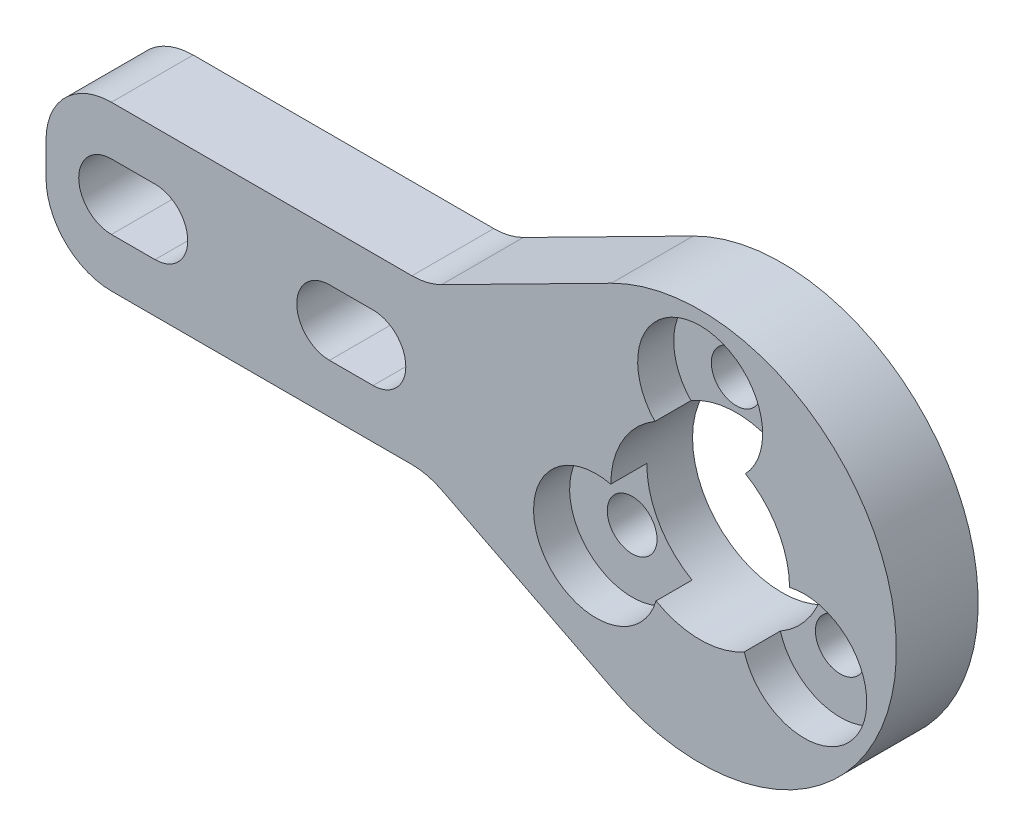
ISO-10303-21;
HEADER;
FILE_DESCRIPTION(('STEP AP214'),'2;1');
FILE_NAME('part.step','',(''),(''),'','','');
FILE_SCHEMA(('AUTOMOTIVE_DESIGN { 1 0 10303 214 1 1 1 1 }'));
ENDSEC;
DATA;
#1=APPLICATION_CONTEXT('core data for automotive mechanical design processes');
#2=APPLICATION_PROTOCOL_DEFINITION('international standard','automotive_design',2000,#1);
#3=PRODUCT_CONTEXT('',#1,'mechanical');
#4=PRODUCT('Part','Part','',(#3));
#5=PRODUCT_RELATED_PRODUCT_CATEGORY('part','',(#4));
#6=PRODUCT_DEFINITION_FORMATION('','',#4);
#7=PRODUCT_DEFINITION_CONTEXT('part definition',#1,'design');
#8=PRODUCT_DEFINITION('design','',#6,#7);
#9=PRODUCT_DEFINITION_SHAPE('','',#8);
#10=(LENGTH_UNIT() NAMED_UNIT(*) SI_UNIT(.MILLI.,.METRE.));
#11=(NAMED_UNIT(*) PLANE_ANGLE_UNIT() SI_UNIT($,.RADIAN.));
#12=(NAMED_UNIT(*) SI_UNIT($,.STERADIAN.) SOLID_ANGLE_UNIT());
#13=UNCERTAINTY_MEASURE_WITH_UNIT(LENGTH_MEASURE(1.E-05),#10,'distance_accuracy_value','');
#14=(GEOMETRIC_REPRESENTATION_CONTEXT(3) GLOBAL_UNCERTAINTY_ASSIGNED_CONTEXT((#13)) GLOBAL_UNIT_ASSIGNED_CONTEXT((#10,
#11,#12)) REPRESENTATION_CONTEXT('',''));
#15=CARTESIAN_POINT('',(0.,0.,0.));
#16=DIRECTION('',(0.,0.,1.));
#17=DIRECTION('',(1.,0.,0.));
#18=AXIS2_PLACEMENT_3D('',#15,#16,#17);
#19=CARTESIAN_POINT('',(0.,0.,4.7625));
#20=DIRECTION('',(0.,0.,1.));
#21=DIRECTION('',(1.,0.,0.));
#22=AXIS2_PLACEMENT_3D('',#19,#20,#21);
#23=PLANE('',#22);
#24=CARTESIAN_POINT('',(-19.05,0.,4.7625));
#25=DIRECTION('',(0.,0.,1.));
#26=DIRECTION('',(1.,0.,0.));
#27=AXIS2_PLACEMENT_3D('',#24,#25,#26);
#28=CIRCLE('',#27,1.905);
#29=CARTESIAN_POINT('',(-19.05,-1.905,4.7625));
#30=VERTEX_POINT('',#29);
#31=CARTESIAN_POINT('',(-19.05,1.905,4.7625));
#32=VERTEX_POINT('',#31);
#33=EDGE_CURVE('E222',#30,#32,#28,.T.);
#34=ORIENTED_EDGE('',*,*,#33,.F.);
#35=DIRECTION('',(1.,0.,0.));
#36=VECTOR('',#35,1.);
#37=CARTESIAN_POINT('',(-21.59,-1.905,4.7625));
#38=LINE('',#37,#36);
#39=CARTESIAN_POINT('',(-21.59,-1.905,4.7625));
#40=VERTEX_POINT('',#39);
#41=EDGE_CURVE('E226',#40,#30,#38,.T.);
#42=ORIENTED_EDGE('',*,*,#41,.F.);
#43=CARTESIAN_POINT('',(-21.59,0.,4.7625));
#44=DIRECTION('',(0.,0.,1.));
#45=DIRECTION('',(1.,0.,0.));
#46=AXIS2_PLACEMENT_3D('',#43,#44,#45);
#47=CIRCLE('',#46,1.905);
#48=CARTESIAN_POINT('',(-21.59,1.905,4.7625));
#49=VERTEX_POINT('',#48);
#50=EDGE_CURVE('E206',#49,#40,#47,.T.);
#51=ORIENTED_EDGE('',*,*,#50,.F.);
#52=DIRECTION('',(-1.,0.,0.));
#53=VECTOR('',#52,1.);
#54=CARTESIAN_POINT('',(-19.05,1.905,4.7625));
#55=LINE('',#54,#53);
#56=EDGE_CURVE('E218',#32,#49,#55,.T.);
#57=ORIENTED_EDGE('',*,*,#56,.F.);
#58=EDGE_LOOP('',(#34,#42,#51,#57));
#59=FACE_BOUND('',#58,.T.);
#60=CARTESIAN_POINT('',(-34.29,0.,4.7625));
#61=DIRECTION('',(0.,0.,1.));
#62=DIRECTION('',(-1.,0.,0.));
#63=AXIS2_PLACEMENT_3D('',#60,#61,#62);
#64=CIRCLE('',#63,1.905);
#65=CARTESIAN_POINT('',(-34.29,1.905,4.7625));
#66=VERTEX_POINT('',#65);
#67=CARTESIAN_POINT('',(-34.29,-1.905,4.7625));
#68=VERTEX_POINT('',#67);
#69=EDGE_CURVE('E242',#66,#68,#64,.T.);
#70=ORIENTED_EDGE('',*,*,#69,.F.);
#71=DIRECTION('',(-1.,0.,0.));
#72=VECTOR('',#71,1.);
#73=CARTESIAN_POINT('',(-34.29,1.905,4.7625));
#74=LINE('',#73,#72);
#75=CARTESIAN_POINT('',(-31.75,1.905,4.7625));
#76=VERTEX_POINT('',#75);
#77=EDGE_CURVE('E252',#76,#66,#74,.T.);
#78=ORIENTED_EDGE('',*,*,#77,.F.);
#79=CARTESIAN_POINT('',(-31.75,0.,4.7625));
#80=DIRECTION('',(0.,0.,1.));
#81=DIRECTION('',(-1.,0.,0.));
#82=AXIS2_PLACEMENT_3D('',#79,#80,#81);
#83=CIRCLE('',#82,1.905);
#84=CARTESIAN_POINT('',(-31.75,-1.905,4.7625));
#85=VERTEX_POINT('',#84);
#86=EDGE_CURVE('E249',#85,#76,#83,.T.);
#87=ORIENTED_EDGE('',*,*,#86,.F.);
#88=DIRECTION('',(1.,0.,0.));
#89=VECTOR('',#88,1.);
#90=CARTESIAN_POINT('',(-31.75,-1.905,4.7625));
#91=LINE('',#90,#89);
#92=EDGE_CURVE('E246',#68,#85,#91,.T.);
#93=ORIENTED_EDGE('',*,*,#92,.F.);
#94=EDGE_LOOP('',(#70,#78,#87,#93));
#95=FACE_BOUND('',#94,.T.);
#96=CARTESIAN_POINT('',(0.,7.,4.7625));
#97=DIRECTION('',(0.,0.,1.));
#98=DIRECTION('',(1.,0.,0.));
#99=AXIS2_PLACEMENT_3D('',#96,#97,#98);
#100=CIRCLE('',#99,3.64);
#101=CARTESIAN_POINT('',(2.63641137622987,4.49023207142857,4.7625));
#102=VERTEX_POINT('',#101);
#103=CARTESIAN_POINT('',(-2.63641137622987,4.49023207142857,4.7625));
#104=VERTEX_POINT('',#103);
#105=EDGE_CURVE('E284',#102,#104,#100,.T.);
#106=ORIENTED_EDGE('',*,*,#105,.F.);
#107=CARTESIAN_POINT('',(0.,0.,4.7625));
#108=DIRECTION('',(0.,0.,1.));
#109=DIRECTION('',(1.,0.,0.));
#110=AXIS2_PLACEMENT_3D('',#107,#108,#109);
#111=CIRCLE('',#110,5.207);
#112=CARTESIAN_POINT('',(5.2068607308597,0.0380831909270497,4.7625));
#113=VERTEX_POINT('',#112);
#114=EDGE_CURVE('E314',#113,#102,#111,.T.);
#115=ORIENTED_EDGE('',*,*,#114,.F.);
#116=CARTESIAN_POINT('',(6.06217782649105,-3.50000000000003,4.7625));
#117=DIRECTION('',(0.,0.,1.));
#118=DIRECTION('',(1.,0.,0.));
#119=AXIS2_PLACEMENT_3D('',#116,#117,#118);
#120=CIRCLE('',#119,3.64);
#121=CARTESIAN_POINT('',(2.57044935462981,-4.52831526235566,4.7625));
#122=VERTEX_POINT('',#121);
#123=EDGE_CURVE('E294',#122,#113,#120,.T.);
#124=ORIENTED_EDGE('',*,*,#123,.F.);
#125=CARTESIAN_POINT('',(-2.57044935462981,-4.52831526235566,4.7625));
#126=VERTEX_POINT('',#125);
#127=EDGE_CURVE('E310',#126,#122,#111,.T.);
#128=ORIENTED_EDGE('',*,*,#127,.F.);
#129=CARTESIAN_POINT('',(-6.06217782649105,-3.50000000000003,4.7625));
#130=DIRECTION('',(0.,0.,1.));
#131=DIRECTION('',(1.,0.,0.));
#132=AXIS2_PLACEMENT_3D('',#129,#130,#131);
#133=CIRCLE('',#132,3.64);
#134=CARTESIAN_POINT('',(-5.2068607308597,0.0380831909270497,4.7625));
#135=VERTEX_POINT('',#134);
#136=EDGE_CURVE('E304',#135,#126,#133,.T.);
#137=ORIENTED_EDGE('',*,*,#136,.F.);
#138=EDGE_CURVE('E309',#104,#135,#111,.T.);
#139=ORIENTED_EDGE('',*,*,#138,.F.);
#140=EDGE_LOOP('',(#106,#115,#124,#128,#137,#139));
#141=FACE_BOUND('',#140,.T.);
#142=DIRECTION('',(0.,-1.,0.));
#143=VECTOR('',#142,1.);
#144=CARTESIAN_POINT('',(-38.1,4.7625,4.7625));
#145=LINE('',#144,#143);
#146=CARTESIAN_POINT('',(-38.1,0.952499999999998,4.7625));
#147=VERTEX_POINT('',#146);
#148=CARTESIAN_POINT('',(-38.1,-0.952500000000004,4.7625));
#149=VERTEX_POINT('',#148);
#150=EDGE_CURVE('E338',#147,#149,#145,.T.);
#151=ORIENTED_EDGE('',*,*,#150,.T.);
#152=CARTESIAN_POINT('',(-34.29,-0.952500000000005,4.7625));
#153=DIRECTION('',(0.,0.,1.));
#154=DIRECTION('',(1.,0.,0.));
#155=AXIS2_PLACEMENT_3D('',#152,#153,#154);
#156=CIRCLE('',#155,3.81);
#157=CARTESIAN_POINT('',(-34.29,-4.7625,4.7625));
#158=VERTEX_POINT('',#157);
#159=EDGE_CURVE('E397',#149,#158,#156,.T.);
#160=ORIENTED_EDGE('',*,*,#159,.T.);
#161=DIRECTION('',(1.,0.,0.));
#162=VECTOR('',#161,1.);
#163=CARTESIAN_POINT('',(-15.875,-4.7625,4.7625));
#164=LINE('',#163,#162);
#165=CARTESIAN_POINT('',(-16.7862536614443,-4.7625,4.7625));
#166=VERTEX_POINT('',#165);
#167=EDGE_CURVE('E340',#158,#166,#164,.T.);
#168=ORIENTED_EDGE('',*,*,#167,.T.);
#169=CARTESIAN_POINT('',(-16.7862536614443,-8.5725,4.7625));
#170=DIRECTION('',(0.,0.,1.));
#171=DIRECTION('',(1.,0.,0.));
#172=AXIS2_PLACEMENT_3D('',#169,#170,#171);
#173=CIRCLE('',#172,3.81);
#174=CARTESIAN_POINT('',(-15.0623604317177,-5.17481076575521,4.7625));
#175=VERTEX_POINT('',#174);
#176=EDGE_CURVE('E401',#166,#175,#173,.F.);
#177=ORIENTED_EDGE('',*,*,#176,.T.);
#178=DIRECTION('',(0.891781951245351,-0.452465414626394,0.));
#179=VECTOR('',#178,1.);
#180=CARTESIAN_POINT('',(-5.17167968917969,-10.1930677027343,4.7625));
#181=LINE('',#180,#179);
#182=CARTESIAN_POINT('',(-5.17167968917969,-10.1930677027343,4.7625));
#183=VERTEX_POINT('',#182);
#184=EDGE_CURVE('E343',#175,#183,#181,.T.);
#185=ORIENTED_EDGE('',*,*,#184,.T.);
#186=CARTESIAN_POINT('',(0.,0.,4.7625));
#187=DIRECTION('',(0.,0.,1.));
#188=DIRECTION('',(1.,0.,0.));
#189=AXIS2_PLACEMENT_3D('',#186,#187,#188);
#190=CIRCLE('',#189,11.43);
#191=CARTESIAN_POINT('',(-5.1716796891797,10.1930677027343,4.7625));
#192=VERTEX_POINT('',#191);
#193=EDGE_CURVE('E330',#183,#192,#190,.T.);
#194=ORIENTED_EDGE('',*,*,#193,.T.);
#195=DIRECTION('',(-0.891781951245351,-0.452465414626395,0.));
#196=VECTOR('',#195,1.);
#197=CARTESIAN_POINT('',(-5.1716796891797,10.1930677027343,4.7625));
#198=LINE('',#197,#196);
#199=CARTESIAN_POINT('',(-15.0623604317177,5.17481076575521,4.7625));
#200=VERTEX_POINT('',#199);
#201=EDGE_CURVE('E333',#192,#200,#198,.T.);
#202=ORIENTED_EDGE('',*,*,#201,.T.);
#203=CARTESIAN_POINT('',(-16.7862536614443,8.5725,4.7625));
#204=DIRECTION('',(0.,0.,1.));
#205=DIRECTION('',(1.,0.,0.));
#206=AXIS2_PLACEMENT_3D('',#203,#204,#205);
#207=CIRCLE('',#206,3.81);
#208=CARTESIAN_POINT('',(-16.7862536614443,4.7625,4.7625));
#209=VERTEX_POINT('',#208);
#210=EDGE_CURVE('E13',#200,#209,#207,.F.);
#211=ORIENTED_EDGE('',*,*,#210,.T.);
#212=DIRECTION('',(-1.,0.,0.));
#213=VECTOR('',#212,1.);
#214=CARTESIAN_POINT('',(-15.875,4.7625,4.7625));
#215=LINE('',#214,#213);
#216=CARTESIAN_POINT('',(-34.29,4.7625,4.7625));
#217=VERTEX_POINT('',#216);
#218=EDGE_CURVE('E336',#209,#217,#215,.T.);
#219=ORIENTED_EDGE('',*,*,#218,.T.);
#220=CARTESIAN_POINT('',(-34.29,0.952499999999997,4.7625));
#221=DIRECTION('',(0.,0.,1.));
#222=DIRECTION('',(1.,0.,0.));
#223=AXIS2_PLACEMENT_3D('',#220,#221,#222);
#224=CIRCLE('',#223,3.81);
#225=EDGE_CURVE('E62',#217,#147,#224,.T.);
#226=ORIENTED_EDGE('',*,*,#225,.T.);
#227=EDGE_LOOP('',(#151,#160,#168,#177,#185,#194,#202,#211,#219,#226));
#228=FACE_BOUND('',#227,.T.);
#229=ADVANCED_FACE('F40',(#59,#95,#141,#228),#23,.T.);
#230=CARTESIAN_POINT('',(0.,0.,0.));
#231=DIRECTION('',(0.,0.,1.));
#232=DIRECTION('',(1.,0.,0.));
#233=AXIS2_PLACEMENT_3D('',#230,#231,#232);
#234=PLANE('',#233);
#235=DIRECTION('',(1.,0.,0.));
#236=VECTOR('',#235,1.);
#237=CARTESIAN_POINT('',(-21.59,-1.905,0.));
#238=LINE('',#237,#236);
#239=CARTESIAN_POINT('',(-21.59,-1.905,0.));
#240=VERTEX_POINT('',#239);
#241=CARTESIAN_POINT('',(-19.05,-1.905,0.));
#242=VERTEX_POINT('',#241);
#243=EDGE_CURVE('E237',#240,#242,#238,.T.);
#244=ORIENTED_EDGE('',*,*,#243,.T.);
#245=CARTESIAN_POINT('',(-19.05,0.,0.));
#246=DIRECTION('',(0.,0.,1.));
#247=DIRECTION('',(1.,0.,0.));
#248=AXIS2_PLACEMENT_3D('',#245,#246,#247);
#249=CIRCLE('',#248,1.905);
#250=CARTESIAN_POINT('',(-19.05,1.905,0.));
#251=VERTEX_POINT('',#250);
#252=EDGE_CURVE('E228',#242,#251,#249,.T.);
#253=ORIENTED_EDGE('',*,*,#252,.T.);
#254=DIRECTION('',(-1.,0.,0.));
#255=VECTOR('',#254,1.);
#256=CARTESIAN_POINT('',(-19.05,1.905,0.));
#257=LINE('',#256,#255);
#258=CARTESIAN_POINT('',(-21.59,1.905,0.));
#259=VERTEX_POINT('',#258);
#260=EDGE_CURVE('E234',#251,#259,#257,.T.);
#261=ORIENTED_EDGE('',*,*,#260,.T.);
#262=CARTESIAN_POINT('',(-21.59,0.,0.));
#263=DIRECTION('',(0.,0.,1.));
#264=DIRECTION('',(1.,0.,0.));
#265=AXIS2_PLACEMENT_3D('',#262,#263,#264);
#266=CIRCLE('',#265,1.905);
#267=EDGE_CURVE('E209',#259,#240,#266,.T.);
#268=ORIENTED_EDGE('',*,*,#267,.T.);
#269=EDGE_LOOP('',(#244,#253,#261,#268));
#270=FACE_BOUND('',#269,.T.);
#271=DIRECTION('',(-1.,0.,0.));
#272=VECTOR('',#271,1.);
#273=CARTESIAN_POINT('',(-34.29,1.905,0.));
#274=LINE('',#273,#272);
#275=CARTESIAN_POINT('',(-31.75,1.905,0.));
#276=VERTEX_POINT('',#275);
#277=CARTESIAN_POINT('',(-34.29,1.905,0.));
#278=VERTEX_POINT('',#277);
#279=EDGE_CURVE('E264',#276,#278,#274,.T.);
#280=ORIENTED_EDGE('',*,*,#279,.T.);
#281=CARTESIAN_POINT('',(-34.29,0.,0.));
#282=DIRECTION('',(0.,0.,1.));
#283=DIRECTION('',(-1.,0.,0.));
#284=AXIS2_PLACEMENT_3D('',#281,#282,#283);
#285=CIRCLE('',#284,1.905);
#286=CARTESIAN_POINT('',(-34.29,-1.905,0.));
#287=VERTEX_POINT('',#286);
#288=EDGE_CURVE('E255',#278,#287,#285,.T.);
#289=ORIENTED_EDGE('',*,*,#288,.T.);
#290=DIRECTION('',(1.,0.,0.));
#291=VECTOR('',#290,1.);
#292=CARTESIAN_POINT('',(-31.75,-1.905,0.));
#293=LINE('',#292,#291);
#294=CARTESIAN_POINT('',(-31.75,-1.905,0.));
#295=VERTEX_POINT('',#294);
#296=EDGE_CURVE('E258',#287,#295,#293,.T.);
#297=ORIENTED_EDGE('',*,*,#296,.T.);
#298=CARTESIAN_POINT('',(-31.75,0.,0.));
#299=DIRECTION('',(0.,0.,1.));
#300=DIRECTION('',(-1.,0.,0.));
#301=AXIS2_PLACEMENT_3D('',#298,#299,#300);
#302=CIRCLE('',#301,1.905);
#303=EDGE_CURVE('E261',#295,#276,#302,.T.);
#304=ORIENTED_EDGE('',*,*,#303,.T.);
#305=EDGE_LOOP('',(#280,#289,#297,#304));
#306=FACE_BOUND('',#305,.T.);
#307=CARTESIAN_POINT('',(0.,7.,0.));
#308=DIRECTION('',(0.,0.,1.));
#309=DIRECTION('',(1.,0.,0.));
#310=AXIS2_PLACEMENT_3D('',#307,#308,#309);
#311=CIRCLE('',#310,1.45);
#312=CARTESIAN_POINT('',(1.45,7.,0.));
#313=VERTEX_POINT('',#312);
#314=EDGE_CURVE('E270',#313,#313,#311,.T.);
#315=ORIENTED_EDGE('',*,*,#314,.T.);
#316=EDGE_LOOP('',(#315));
#317=FACE_BOUND('',#316,.T.);
#318=CARTESIAN_POINT('',(6.06217782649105,-3.50000000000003,0.));
#319=DIRECTION('',(0.,0.,1.));
#320=DIRECTION('',(1.,0.,0.));
#321=AXIS2_PLACEMENT_3D('',#318,#319,#320);
#322=CIRCLE('',#321,1.45);
#323=CARTESIAN_POINT('',(7.51217782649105,-3.50000000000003,0.));
#324=VERTEX_POINT('',#323);
#325=EDGE_CURVE('E286',#324,#324,#322,.T.);
#326=ORIENTED_EDGE('',*,*,#325,.T.);
#327=EDGE_LOOP('',(#326));
#328=FACE_BOUND('',#327,.T.);
#329=CARTESIAN_POINT('',(-6.06217782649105,-3.50000000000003,0.));
#330=DIRECTION('',(0.,0.,1.));
#331=DIRECTION('',(1.,0.,0.));
#332=AXIS2_PLACEMENT_3D('',#329,#330,#331);
#333=CIRCLE('',#332,1.45);
#334=CARTESIAN_POINT('',(-4.61217782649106,-3.50000000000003,0.));
#335=VERTEX_POINT('',#334);
#336=EDGE_CURVE('E296',#335,#335,#333,.T.);
#337=ORIENTED_EDGE('',*,*,#336,.T.);
#338=EDGE_LOOP('',(#337));
#339=FACE_BOUND('',#338,.T.);
#340=DIRECTION('',(1.,0.,0.));
#341=VECTOR('',#340,1.);
#342=CARTESIAN_POINT('',(-15.875,-4.7625,0.));
#343=LINE('',#342,#341);
#344=CARTESIAN_POINT('',(-34.29,-4.7625,0.));
#345=VERTEX_POINT('',#344);
#346=CARTESIAN_POINT('',(-16.7862536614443,-4.7625,0.));
#347=VERTEX_POINT('',#346);
#348=EDGE_CURVE('E325',#345,#347,#343,.T.);
#349=ORIENTED_EDGE('',*,*,#348,.F.);
#350=CARTESIAN_POINT('',(-34.29,-0.952500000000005,0.));
#351=DIRECTION('',(0.,0.,1.));
#352=DIRECTION('',(1.,0.,0.));
#353=AXIS2_PLACEMENT_3D('',#350,#351,#352);
#354=CIRCLE('',#353,3.81);
#355=CARTESIAN_POINT('',(-38.1,-0.952500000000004,0.));
#356=VERTEX_POINT('',#355);
#357=EDGE_CURVE('E390',#345,#356,#354,.F.);
#358=ORIENTED_EDGE('',*,*,#357,.T.);
#359=DIRECTION('',(0.,-1.,0.));
#360=VECTOR('',#359,1.);
#361=CARTESIAN_POINT('',(-38.1,4.7625,0.));
#362=LINE('',#361,#360);
#363=CARTESIAN_POINT('',(-38.1,0.952499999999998,0.));
#364=VERTEX_POINT('',#363);
#365=EDGE_CURVE('E323',#364,#356,#362,.T.);
#366=ORIENTED_EDGE('',*,*,#365,.F.);
#367=CARTESIAN_POINT('',(-34.29,0.952499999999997,0.));
#368=DIRECTION('',(0.,0.,1.));
#369=DIRECTION('',(1.,0.,0.));
#370=AXIS2_PLACEMENT_3D('',#367,#368,#369);
#371=CIRCLE('',#370,3.81);
#372=CARTESIAN_POINT('',(-34.29,4.7625,0.));
#373=VERTEX_POINT('',#372);
#374=EDGE_CURVE('E388',#364,#373,#371,.F.);
#375=ORIENTED_EDGE('',*,*,#374,.T.);
#376=DIRECTION('',(-1.,0.,0.));
#377=VECTOR('',#376,1.);
#378=CARTESIAN_POINT('',(-15.875,4.7625,0.));
#379=LINE('',#378,#377);
#380=CARTESIAN_POINT('',(-16.7862536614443,4.7625,0.));
#381=VERTEX_POINT('',#380);
#382=EDGE_CURVE('E320',#381,#373,#379,.T.);
#383=ORIENTED_EDGE('',*,*,#382,.F.);
#384=CARTESIAN_POINT('',(-16.7862536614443,8.5725,0.));
#385=DIRECTION('',(0.,0.,1.));
#386=DIRECTION('',(1.,0.,0.));
#387=AXIS2_PLACEMENT_3D('',#384,#385,#386);
#388=CIRCLE('',#387,3.81);
#389=CARTESIAN_POINT('',(-15.0623604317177,5.17481076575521,0.));
#390=VERTEX_POINT('',#389);
#391=EDGE_CURVE('E48',#381,#390,#388,.T.);
#392=ORIENTED_EDGE('',*,*,#391,.T.);
#393=DIRECTION('',(-0.891781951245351,-0.452465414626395,0.));
#394=VECTOR('',#393,1.);
#395=CARTESIAN_POINT('',(-5.1716796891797,10.1930677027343,0.));
#396=LINE('',#395,#394);
#397=CARTESIAN_POINT('',(-5.1716796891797,10.1930677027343,0.));
#398=VERTEX_POINT('',#397);
#399=EDGE_CURVE('E317',#398,#390,#396,.T.);
#400=ORIENTED_EDGE('',*,*,#399,.F.);
#401=CARTESIAN_POINT('',(0.,0.,0.));
#402=DIRECTION('',(0.,0.,1.));
#403=DIRECTION('',(1.,0.,0.));
#404=AXIS2_PLACEMENT_3D('',#401,#402,#403);
#405=CIRCLE('',#404,11.43);
#406=CARTESIAN_POINT('',(-5.17167968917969,-10.1930677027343,0.));
#407=VERTEX_POINT('',#406);
#408=EDGE_CURVE('E313',#407,#398,#405,.T.);
#409=ORIENTED_EDGE('',*,*,#408,.F.);
#410=DIRECTION('',(0.891781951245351,-0.452465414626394,0.));
#411=VECTOR('',#410,1.);
#412=CARTESIAN_POINT('',(-5.17167968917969,-10.1930677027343,0.));
#413=LINE('',#412,#411);
#414=CARTESIAN_POINT('',(-15.0623604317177,-5.17481076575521,0.));
#415=VERTEX_POINT('',#414);
#416=EDGE_CURVE('E328',#415,#407,#413,.T.);
#417=ORIENTED_EDGE('',*,*,#416,.F.);
#418=CARTESIAN_POINT('',(-16.7862536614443,-8.5725,0.));
#419=DIRECTION('',(0.,0.,1.));
#420=DIRECTION('',(1.,0.,0.));
#421=AXIS2_PLACEMENT_3D('',#418,#419,#420);
#422=CIRCLE('',#421,3.81);
#423=EDGE_CURVE('E399',#415,#347,#422,.T.);
#424=ORIENTED_EDGE('',*,*,#423,.T.);
#425=EDGE_LOOP('',(#349,#358,#366,#375,#383,#392,#400,#409,#417,#424));
#426=FACE_BOUND('',#425,.T.);
#427=CARTESIAN_POINT('',(0.,0.,0.));
#428=DIRECTION('',(0.,0.,1.));
#429=DIRECTION('',(1.,0.,0.));
#430=AXIS2_PLACEMENT_3D('',#427,#428,#429);
#431=CIRCLE('',#430,5.207);
#432=CARTESIAN_POINT('',(5.207,0.,0.));
#433=VERTEX_POINT('',#432);
#434=EDGE_CURVE('E306',#433,#433,#431,.T.);
#435=ORIENTED_EDGE('',*,*,#434,.T.);
#436=EDGE_LOOP('',(#435));
#437=FACE_BOUND('',#436,.T.);
#438=ADVANCED_FACE('F405',(#270,#306,#317,#328,#339,#426,#437),#234,.F.);
#439=CARTESIAN_POINT('',(0.,0.,4.7625));
#440=DIRECTION('',(0.,0.,-1.));
#441=DIRECTION('',(-1.,0.,0.));
#442=AXIS2_PLACEMENT_3D('',#439,#440,#441);
#443=CYLINDRICAL_SURFACE('',#442,11.43);
#444=ORIENTED_EDGE('',*,*,#408,.T.);
#445=DIRECTION('',(0.,0.,-1.));
#446=VECTOR('',#445,1.);
#447=CARTESIAN_POINT('',(-5.1716796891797,10.1930677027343,4.7625));
#448=LINE('',#447,#446);
#449=EDGE_CURVE('E348',#192,#398,#448,.T.);
#450=ORIENTED_EDGE('',*,*,#449,.F.);
#451=ORIENTED_EDGE('',*,*,#193,.F.);
#452=DIRECTION('',(0.,0.,-1.));
#453=VECTOR('',#452,1.);
#454=CARTESIAN_POINT('',(-5.17167968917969,-10.1930677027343,4.7625));
#455=LINE('',#454,#453);
#456=EDGE_CURVE('E345',#183,#407,#455,.T.);
#457=ORIENTED_EDGE('',*,*,#456,.T.);
#458=EDGE_LOOP('',(#444,#450,#451,#457));
#459=FACE_BOUND('',#458,.T.);
#460=ADVANCED_FACE('F42',(#459),#443,.T.);
#461=CARTESIAN_POINT('',(-5.1716796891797,10.1930677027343,4.7625));
#462=DIRECTION('',(0.452465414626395,-0.891781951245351,0.));
#463=DIRECTION('',(0.891781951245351,0.452465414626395,0.));
#464=AXIS2_PLACEMENT_3D('',#461,#462,#463);
#465=PLANE('',#464);
#466=ORIENTED_EDGE('',*,*,#399,.T.);
#467=DIRECTION('',(0.,0.,-1.));
#468=VECTOR('',#467,1.);
#469=CARTESIAN_POINT('',(-15.0623604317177,5.17481076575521,4.7625));
#470=LINE('',#469,#468);
#471=EDGE_CURVE('E386',#390,#200,#470,.F.);
#472=ORIENTED_EDGE('',*,*,#471,.T.);
#473=ORIENTED_EDGE('',*,*,#201,.F.);
#474=ORIENTED_EDGE('',*,*,#449,.T.);
#475=EDGE_LOOP('',(#466,#472,#473,#474));
#476=FACE_BOUND('',#475,.T.);
#477=ADVANCED_FACE('F412',(#476),#465,.F.);
#478=CARTESIAN_POINT('',(-15.875,4.7625,4.7625));
#479=DIRECTION('',(0.,-1.,0.));
#480=DIRECTION('',(1.,0.,0.));
#481=AXIS2_PLACEMENT_3D('',#478,#479,#480);
#482=PLANE('',#481);
#483=ORIENTED_EDGE('',*,*,#218,.F.);
#484=DIRECTION('',(0.,0.,-1.));
#485=VECTOR('',#484,1.);
#486=CARTESIAN_POINT('',(-16.7862536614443,4.7625,0.));
#487=LINE('',#486,#485);
#488=EDGE_CURVE('E383',#209,#381,#487,.T.);
#489=ORIENTED_EDGE('',*,*,#488,.T.);
#490=ORIENTED_EDGE('',*,*,#382,.T.);
#491=DIRECTION('',(0.,0.,-1.));
#492=VECTOR('',#491,1.);
#493=CARTESIAN_POINT('',(-34.29,4.7625,4.7625));
#494=LINE('',#493,#492);
#495=EDGE_CURVE('E381',#373,#217,#494,.F.);
#496=ORIENTED_EDGE('',*,*,#495,.T.);
#497=EDGE_LOOP('',(#483,#489,#490,#496));
#498=FACE_BOUND('',#497,.T.);
#499=ADVANCED_FACE('F418',(#498),#482,.F.);
#500=CARTESIAN_POINT('',(-38.1,4.7625,4.7625));
#501=DIRECTION('',(1.,0.,0.));
#502=DIRECTION('',(0.,0.,-1.));
#503=AXIS2_PLACEMENT_3D('',#500,#501,#502);
#504=PLANE('',#503);
#505=ORIENTED_EDGE('',*,*,#365,.T.);
#506=DIRECTION('',(0.,0.,-1.));
#507=VECTOR('',#506,1.);
#508=CARTESIAN_POINT('',(-38.1,-0.952500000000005,4.7625));
#509=LINE('',#508,#507);
#510=EDGE_CURVE('E55',#356,#149,#509,.F.);
#511=ORIENTED_EDGE('',*,*,#510,.T.);
#512=ORIENTED_EDGE('',*,*,#150,.F.);
#513=DIRECTION('',(0.,0.,-1.));
#514=VECTOR('',#513,1.);
#515=CARTESIAN_POINT('',(-38.1,0.952499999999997,4.7625));
#516=LINE('',#515,#514);
#517=EDGE_CURVE('E392',#147,#364,#516,.T.);
#518=ORIENTED_EDGE('',*,*,#517,.T.);
#519=EDGE_LOOP('',(#505,#511,#512,#518));
#520=FACE_BOUND('',#519,.T.);
#521=ADVANCED_FACE('F424',(#520),#504,.F.);
#522=CARTESIAN_POINT('',(-15.875,-4.7625,4.7625));
#523=DIRECTION('',(0.,1.,0.));
#524=DIRECTION('',(-1.,0.,0.));
#525=AXIS2_PLACEMENT_3D('',#522,#523,#524);
#526=PLANE('',#525);
#527=ORIENTED_EDGE('',*,*,#348,.T.);
#528=DIRECTION('',(0.,0.,-1.));
#529=VECTOR('',#528,1.);
#530=CARTESIAN_POINT('',(-16.7862536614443,-4.7625,4.7625));
#531=LINE('',#530,#529);
#532=EDGE_CURVE('E379',#347,#166,#531,.F.);
#533=ORIENTED_EDGE('',*,*,#532,.T.);
#534=ORIENTED_EDGE('',*,*,#167,.F.);
#535=DIRECTION('',(0.,0.,-1.));
#536=VECTOR('',#535,1.);
#537=CARTESIAN_POINT('',(-34.29,-4.7625,4.7625));
#538=LINE('',#537,#536);
#539=EDGE_CURVE('E376',#158,#345,#538,.T.);
#540=ORIENTED_EDGE('',*,*,#539,.T.);
#541=EDGE_LOOP('',(#527,#533,#534,#540));
#542=FACE_BOUND('',#541,.T.);
#543=ADVANCED_FACE('F431',(#542),#526,.F.);
#544=CARTESIAN_POINT('',(-5.17167968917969,-10.1930677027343,4.7625));
#545=DIRECTION('',(0.452465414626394,0.891781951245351,0.));
#546=DIRECTION('',(-0.891781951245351,0.452465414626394,0.));
#547=AXIS2_PLACEMENT_3D('',#544,#545,#546);
#548=PLANE('',#547);
#549=ORIENTED_EDGE('',*,*,#184,.F.);
#550=DIRECTION('',(0.,0.,-1.));
#551=VECTOR('',#550,1.);
#552=CARTESIAN_POINT('',(-15.0623604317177,-5.17481076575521,0.));
#553=LINE('',#552,#551);
#554=EDGE_CURVE('E373',#175,#415,#553,.T.);
#555=ORIENTED_EDGE('',*,*,#554,.T.);
#556=ORIENTED_EDGE('',*,*,#416,.T.);
#557=ORIENTED_EDGE('',*,*,#456,.F.);
#558=EDGE_LOOP('',(#549,#555,#556,#557));
#559=FACE_BOUND('',#558,.T.);
#560=ADVANCED_FACE('F440',(#559),#548,.F.);
#561=CARTESIAN_POINT('',(0.,0.,4.7625));
#562=DIRECTION('',(0.,0.,-1.));
#563=DIRECTION('',(-1.,0.,0.));
#564=AXIS2_PLACEMENT_3D('',#561,#562,#563);
#565=CYLINDRICAL_SURFACE('',#564,5.207);
#566=DIRECTION('',(0.,0.,1.));
#567=VECTOR('',#566,1.);
#568=CARTESIAN_POINT('',(2.63641137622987,4.49023207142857,3.7125));
#569=LINE('',#568,#567);
#570=CARTESIAN_POINT('',(2.63641137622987,4.49023207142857,2.6625));
#571=VERTEX_POINT('',#570);
#572=EDGE_CURVE('E371',#571,#102,#569,.T.);
#573=ORIENTED_EDGE('',*,*,#572,.F.);
#574=CARTESIAN_POINT('',(0.,0.,2.6625));
#575=DIRECTION('',(0.,0.,-1.));
#576=DIRECTION('',(-1.,0.,0.));
#577=AXIS2_PLACEMENT_3D('',#574,#575,#576);
#578=CIRCLE('',#577,5.207);
#579=CARTESIAN_POINT('',(-2.63641137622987,4.49023207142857,2.6625));
#580=VERTEX_POINT('',#579);
#581=EDGE_CURVE('E366',#580,#571,#578,.T.);
#582=ORIENTED_EDGE('',*,*,#581,.F.);
#583=DIRECTION('',(0.,0.,1.));
#584=VECTOR('',#583,1.);
#585=CARTESIAN_POINT('',(-2.63641137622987,4.49023207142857,3.7125));
#586=LINE('',#585,#584);
#587=EDGE_CURVE('E368',#104,#580,#586,.F.);
#588=ORIENTED_EDGE('',*,*,#587,.F.);
#589=ORIENTED_EDGE('',*,*,#138,.T.);
#590=DIRECTION('',(0.,0.,1.));
#591=VECTOR('',#590,1.);
#592=CARTESIAN_POINT('',(-5.2068607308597,0.0380831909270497,3.7125));
#593=LINE('',#592,#591);
#594=CARTESIAN_POINT('',(-5.2068607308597,0.0380831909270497,2.6625));
#595=VERTEX_POINT('',#594);
#596=EDGE_CURVE('E356',#595,#135,#593,.T.);
#597=ORIENTED_EDGE('',*,*,#596,.F.);
#598=CARTESIAN_POINT('',(0.,0.,2.6625));
#599=DIRECTION('',(0.,0.,-1.));
#600=DIRECTION('',(-1.,0.,0.));
#601=AXIS2_PLACEMENT_3D('',#598,#599,#600);
#602=CIRCLE('',#601,5.207);
#603=CARTESIAN_POINT('',(-2.57044935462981,-4.52831526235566,2.6625));
#604=VERTEX_POINT('',#603);
#605=EDGE_CURVE('E351',#604,#595,#602,.T.);
#606=ORIENTED_EDGE('',*,*,#605,.F.);
#607=DIRECTION('',(0.,0.,1.));
#608=VECTOR('',#607,1.);
#609=CARTESIAN_POINT('',(-2.57044935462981,-4.52831526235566,3.7125));
#610=LINE('',#609,#608);
#611=EDGE_CURVE('E353',#126,#604,#610,.F.);
#612=ORIENTED_EDGE('',*,*,#611,.F.);
#613=ORIENTED_EDGE('',*,*,#127,.T.);
#614=DIRECTION('',(0.,0.,1.));
#615=VECTOR('',#614,1.);
#616=CARTESIAN_POINT('',(2.57044935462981,-4.52831526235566,3.7125));
#617=LINE('',#616,#615);
#618=CARTESIAN_POINT('',(2.57044935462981,-4.52831526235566,2.6625));
#619=VERTEX_POINT('',#618);
#620=EDGE_CURVE('E364',#619,#122,#617,.T.);
#621=ORIENTED_EDGE('',*,*,#620,.F.);
#622=CARTESIAN_POINT('',(0.,0.,2.6625));
#623=DIRECTION('',(0.,0.,-1.));
#624=DIRECTION('',(-1.,0.,0.));
#625=AXIS2_PLACEMENT_3D('',#622,#623,#624);
#626=CIRCLE('',#625,5.207);
#627=CARTESIAN_POINT('',(5.2068607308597,0.0380831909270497,2.6625));
#628=VERTEX_POINT('',#627);
#629=EDGE_CURVE('E359',#628,#619,#626,.T.);
#630=ORIENTED_EDGE('',*,*,#629,.F.);
#631=DIRECTION('',(0.,0.,1.));
#632=VECTOR('',#631,1.);
#633=CARTESIAN_POINT('',(5.2068607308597,0.0380831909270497,3.7125));
#634=LINE('',#633,#632);
#635=EDGE_CURVE('E361',#113,#628,#634,.F.);
#636=ORIENTED_EDGE('',*,*,#635,.F.);
#637=ORIENTED_EDGE('',*,*,#114,.T.);
#638=EDGE_LOOP('',(#573,#582,#588,#589,#597,#606,#612,#613,#621,#630,#636,#637));
#639=FACE_BOUND('',#638,.T.);
#640=ORIENTED_EDGE('',*,*,#434,.F.);
#641=EDGE_LOOP('',(#640));
#642=FACE_BOUND('',#641,.T.);
#643=ADVANCED_FACE('F461',(#639,#642),#565,.F.);
#644=CARTESIAN_POINT('',(-6.06217782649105,-3.50000000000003,4.7625));
#645=DIRECTION('',(0.,0.,1.));
#646=DIRECTION('',(1.,0.,0.));
#647=AXIS2_PLACEMENT_3D('',#644,#645,#646);
#648=CYLINDRICAL_SURFACE('',#647,3.64);
#649=ORIENTED_EDGE('',*,*,#596,.T.);
#650=ORIENTED_EDGE('',*,*,#136,.T.);
#651=ORIENTED_EDGE('',*,*,#611,.T.);
#652=CARTESIAN_POINT('',(-6.06217782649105,-3.50000000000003,2.6625));
#653=DIRECTION('',(0.,0.,1.));
#654=DIRECTION('',(1.,0.,0.));
#655=AXIS2_PLACEMENT_3D('',#652,#653,#654);
#656=CIRCLE('',#655,3.64);
#657=EDGE_CURVE('E302',#595,#604,#656,.T.);
#658=ORIENTED_EDGE('',*,*,#657,.F.);
#659=EDGE_LOOP('',(#649,#650,#651,#658));
#660=FACE_BOUND('',#659,.T.);
#661=ADVANCED_FACE('F570',(#660),#648,.F.);
#662=CARTESIAN_POINT('',(-4.61217782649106,-3.50000000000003,2.6625));
#663=DIRECTION('',(0.,0.,-1.));
#664=DIRECTION('',(-1.,0.,0.));
#665=AXIS2_PLACEMENT_3D('',#662,#663,#664);
#666=PLANE('',#665);
#667=ORIENTED_EDGE('',*,*,#605,.T.);
#668=ORIENTED_EDGE('',*,*,#657,.T.);
#669=EDGE_LOOP('',(#667,#668));
#670=FACE_BOUND('',#669,.T.);
#671=CARTESIAN_POINT('',(-6.06217782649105,-3.50000000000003,2.6625));
#672=DIRECTION('',(0.,0.,1.));
#673=DIRECTION('',(1.,0.,0.));
#674=AXIS2_PLACEMENT_3D('',#671,#672,#673);
#675=CIRCLE('',#674,1.45);
#676=CARTESIAN_POINT('',(-4.61217782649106,-3.50000000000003,2.6625));
#677=VERTEX_POINT('',#676);
#678=EDGE_CURVE('E299',#677,#677,#675,.T.);
#679=ORIENTED_EDGE('',*,*,#678,.F.);
#680=EDGE_LOOP('',(#679));
#681=FACE_BOUND('',#680,.T.);
#682=ADVANCED_FACE('F566',(#670,#681),#666,.F.);
#683=CARTESIAN_POINT('',(-6.06217782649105,-3.50000000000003,4.7625));
#684=DIRECTION('',(0.,0.,1.));
#685=DIRECTION('',(1.,0.,0.));
#686=AXIS2_PLACEMENT_3D('',#683,#684,#685);
#687=CYLINDRICAL_SURFACE('',#686,1.45);
#688=ORIENTED_EDGE('',*,*,#336,.F.);
#689=EDGE_LOOP('',(#688));
#690=FACE_BOUND('',#689,.T.);
#691=ORIENTED_EDGE('',*,*,#678,.T.);
#692=EDGE_LOOP('',(#691));
#693=FACE_BOUND('',#692,.T.);
#694=ADVANCED_FACE('F562',(#690,#693),#687,.F.);
#695=CARTESIAN_POINT('',(6.06217782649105,-3.50000000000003,4.7625));
#696=DIRECTION('',(0.,0.,1.));
#697=DIRECTION('',(1.,0.,0.));
#698=AXIS2_PLACEMENT_3D('',#695,#696,#697);
#699=CYLINDRICAL_SURFACE('',#698,3.64);
#700=ORIENTED_EDGE('',*,*,#620,.T.);
#701=ORIENTED_EDGE('',*,*,#123,.T.);
#702=ORIENTED_EDGE('',*,*,#635,.T.);
#703=CARTESIAN_POINT('',(6.06217782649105,-3.50000000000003,2.6625));
#704=DIRECTION('',(0.,0.,1.));
#705=DIRECTION('',(1.,0.,0.));
#706=AXIS2_PLACEMENT_3D('',#703,#704,#705);
#707=CIRCLE('',#706,3.64);
#708=EDGE_CURVE('E292',#619,#628,#707,.T.);
#709=ORIENTED_EDGE('',*,*,#708,.F.);
#710=EDGE_LOOP('',(#700,#701,#702,#709));
#711=FACE_BOUND('',#710,.T.);
#712=ADVANCED_FACE('F558',(#711),#699,.F.);
#713=CARTESIAN_POINT('',(7.51217782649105,-3.50000000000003,2.6625));
#714=DIRECTION('',(0.,0.,-1.));
#715=DIRECTION('',(-1.,0.,0.));
#716=AXIS2_PLACEMENT_3D('',#713,#714,#715);
#717=PLANE('',#716);
#718=ORIENTED_EDGE('',*,*,#629,.T.);
#719=ORIENTED_EDGE('',*,*,#708,.T.);
#720=EDGE_LOOP('',(#718,#719));
#721=FACE_BOUND('',#720,.T.);
#722=CARTESIAN_POINT('',(6.06217782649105,-3.50000000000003,2.6625));
#723=DIRECTION('',(0.,0.,1.));
#724=DIRECTION('',(1.,0.,0.));
#725=AXIS2_PLACEMENT_3D('',#722,#723,#724);
#726=CIRCLE('',#725,1.45);
#727=CARTESIAN_POINT('',(7.51217782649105,-3.50000000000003,2.6625));
#728=VERTEX_POINT('',#727);
#729=EDGE_CURVE('E289',#728,#728,#726,.T.);
#730=ORIENTED_EDGE('',*,*,#729,.F.);
#731=EDGE_LOOP('',(#730));
#732=FACE_BOUND('',#731,.T.);
#733=ADVANCED_FACE('F554',(#721,#732),#717,.F.);
#734=CARTESIAN_POINT('',(6.06217782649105,-3.50000000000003,4.7625));
#735=DIRECTION('',(0.,0.,1.));
#736=DIRECTION('',(1.,0.,0.));
#737=AXIS2_PLACEMENT_3D('',#734,#735,#736);
#738=CYLINDRICAL_SURFACE('',#737,1.45);
#739=ORIENTED_EDGE('',*,*,#325,.F.);
#740=EDGE_LOOP('',(#739));
#741=FACE_BOUND('',#740,.T.);
#742=ORIENTED_EDGE('',*,*,#729,.T.);
#743=EDGE_LOOP('',(#742));
#744=FACE_BOUND('',#743,.T.);
#745=ADVANCED_FACE('F550',(#741,#744),#738,.F.);
#746=CARTESIAN_POINT('',(0.,7.,4.7625));
#747=DIRECTION('',(0.,0.,1.));
#748=DIRECTION('',(1.,0.,0.));
#749=AXIS2_PLACEMENT_3D('',#746,#747,#748);
#750=CYLINDRICAL_SURFACE('',#749,3.64);
#751=ORIENTED_EDGE('',*,*,#572,.T.);
#752=ORIENTED_EDGE('',*,*,#105,.T.);
#753=ORIENTED_EDGE('',*,*,#587,.T.);
#754=CARTESIAN_POINT('',(0.,7.,2.6625));
#755=DIRECTION('',(0.,0.,1.));
#756=DIRECTION('',(1.,0.,0.));
#757=AXIS2_PLACEMENT_3D('',#754,#755,#756);
#758=CIRCLE('',#757,3.64);
#759=EDGE_CURVE('E282',#571,#580,#758,.T.);
#760=ORIENTED_EDGE('',*,*,#759,.F.);
#761=EDGE_LOOP('',(#751,#752,#753,#760));
#762=FACE_BOUND('',#761,.T.);
#763=ADVANCED_FACE('F546',(#762),#750,.F.);
#764=CARTESIAN_POINT('',(1.45,7.,2.6625));
#765=DIRECTION('',(0.,0.,-1.));
#766=DIRECTION('',(-1.,0.,0.));
#767=AXIS2_PLACEMENT_3D('',#764,#765,#766);
#768=PLANE('',#767);
#769=ORIENTED_EDGE('',*,*,#581,.T.);
#770=ORIENTED_EDGE('',*,*,#759,.T.);
#771=EDGE_LOOP('',(#769,#770));
#772=FACE_BOUND('',#771,.T.);
#773=CARTESIAN_POINT('',(0.,7.,2.6625));
#774=DIRECTION('',(0.,0.,1.));
#775=DIRECTION('',(1.,0.,0.));
#776=AXIS2_PLACEMENT_3D('',#773,#774,#775);
#777=CIRCLE('',#776,1.45);
#778=CARTESIAN_POINT('',(1.45,7.,2.6625));
#779=VERTEX_POINT('',#778);
#780=EDGE_CURVE('E279',#779,#779,#777,.T.);
#781=ORIENTED_EDGE('',*,*,#780,.F.);
#782=EDGE_LOOP('',(#781));
#783=FACE_BOUND('',#782,.T.);
#784=ADVANCED_FACE('F542',(#772,#783),#768,.F.);
#785=CARTESIAN_POINT('',(0.,7.,4.7625));
#786=DIRECTION('',(0.,0.,1.));
#787=DIRECTION('',(1.,0.,0.));
#788=AXIS2_PLACEMENT_3D('',#785,#786,#787);
#789=CYLINDRICAL_SURFACE('',#788,1.45);
#790=ORIENTED_EDGE('',*,*,#314,.F.);
#791=EDGE_LOOP('',(#790));
#792=FACE_BOUND('',#791,.T.);
#793=ORIENTED_EDGE('',*,*,#780,.T.);
#794=EDGE_LOOP('',(#793));
#795=FACE_BOUND('',#794,.T.);
#796=ADVANCED_FACE('F538',(#792,#795),#789,.F.);
#797=CARTESIAN_POINT('',(-34.29,0.,0.));
#798=DIRECTION('',(0.,0.,1.));
#799=DIRECTION('',(1.,0.,0.));
#800=AXIS2_PLACEMENT_3D('',#797,#798,#799);
#801=CYLINDRICAL_SURFACE('',#800,1.905);
#802=ORIENTED_EDGE('',*,*,#69,.T.);
#803=DIRECTION('',(0.,0.,1.));
#804=VECTOR('',#803,1.);
#805=CARTESIAN_POINT('',(-34.29,-1.905,0.));
#806=LINE('',#805,#804);
#807=EDGE_CURVE('E267',#287,#68,#806,.T.);
#808=ORIENTED_EDGE('',*,*,#807,.F.);
#809=ORIENTED_EDGE('',*,*,#288,.F.);
#810=DIRECTION('',(0.,0.,1.));
#811=VECTOR('',#810,1.);
#812=CARTESIAN_POINT('',(-34.29,1.905,0.));
#813=LINE('',#812,#811);
#814=EDGE_CURVE('E268',#278,#66,#813,.T.);
#815=ORIENTED_EDGE('',*,*,#814,.T.);
#816=EDGE_LOOP('',(#802,#808,#809,#815));
#817=FACE_BOUND('',#816,.T.);
#818=ADVANCED_FACE('F528',(#817),#801,.F.);
#819=CARTESIAN_POINT('',(-34.29,1.905,0.));
#820=DIRECTION('',(0.,1.,0.));
#821=DIRECTION('',(-1.,0.,0.));
#822=AXIS2_PLACEMENT_3D('',#819,#820,#821);
#823=PLANE('',#822);
#824=ORIENTED_EDGE('',*,*,#77,.T.);
#825=ORIENTED_EDGE('',*,*,#814,.F.);
#826=ORIENTED_EDGE('',*,*,#279,.F.);
#827=DIRECTION('',(0.,0.,1.));
#828=VECTOR('',#827,1.);
#829=CARTESIAN_POINT('',(-31.75,1.905,0.));
#830=LINE('',#829,#828);
#831=EDGE_CURVE('E271',#276,#76,#830,.T.);
#832=ORIENTED_EDGE('',*,*,#831,.T.);
#833=EDGE_LOOP('',(#824,#825,#826,#832));
#834=FACE_BOUND('',#833,.T.);
#835=ADVANCED_FACE('F524',(#834),#823,.F.);
#836=CARTESIAN_POINT('',(-31.75,0.,0.));
#837=DIRECTION('',(0.,0.,1.));
#838=DIRECTION('',(1.,0.,0.));
#839=AXIS2_PLACEMENT_3D('',#836,#837,#838);
#840=CYLINDRICAL_SURFACE('',#839,1.905);
#841=ORIENTED_EDGE('',*,*,#86,.T.);
#842=ORIENTED_EDGE('',*,*,#831,.F.);
#843=ORIENTED_EDGE('',*,*,#303,.F.);
#844=DIRECTION('',(0.,0.,1.));
#845=VECTOR('',#844,1.);
#846=CARTESIAN_POINT('',(-31.75,-1.905,0.));
#847=LINE('',#846,#845);
#848=EDGE_CURVE('E273',#295,#85,#847,.T.);
#849=ORIENTED_EDGE('',*,*,#848,.T.);
#850=EDGE_LOOP('',(#841,#842,#843,#849));
#851=FACE_BOUND('',#850,.T.);
#852=ADVANCED_FACE('F527',(#851),#840,.F.);
#853=CARTESIAN_POINT('',(-31.75,-1.905,0.));
#854=DIRECTION('',(0.,-1.,0.));
#855=DIRECTION('',(1.,0.,0.));
#856=AXIS2_PLACEMENT_3D('',#853,#854,#855);
#857=PLANE('',#856);
#858=ORIENTED_EDGE('',*,*,#92,.T.);
#859=ORIENTED_EDGE('',*,*,#848,.F.);
#860=ORIENTED_EDGE('',*,*,#296,.F.);
#861=ORIENTED_EDGE('',*,*,#807,.T.);
#862=EDGE_LOOP('',(#858,#859,#860,#861));
#863=FACE_BOUND('',#862,.T.);
#864=ADVANCED_FACE('F522',(#863),#857,.F.);
#865=CARTESIAN_POINT('',(-19.05,0.,0.));
#866=DIRECTION('',(0.,0.,1.));
#867=DIRECTION('',(1.,0.,0.));
#868=AXIS2_PLACEMENT_3D('',#865,#866,#867);
#869=CYLINDRICAL_SURFACE('',#868,1.905);
#870=ORIENTED_EDGE('',*,*,#33,.T.);
#871=DIRECTION('',(0.,0.,1.));
#872=VECTOR('',#871,1.);
#873=CARTESIAN_POINT('',(-19.05,1.905,0.));
#874=LINE('',#873,#872);
#875=EDGE_CURVE('E214',#251,#32,#874,.T.);
#876=ORIENTED_EDGE('',*,*,#875,.F.);
#877=ORIENTED_EDGE('',*,*,#252,.F.);
#878=DIRECTION('',(0.,0.,1.));
#879=VECTOR('',#878,1.);
#880=CARTESIAN_POINT('',(-19.05,-1.905,0.));
#881=LINE('',#880,#879);
#882=EDGE_CURVE('E240',#242,#30,#881,.T.);
#883=ORIENTED_EDGE('',*,*,#882,.T.);
#884=EDGE_LOOP('',(#870,#876,#877,#883));
#885=FACE_BOUND('',#884,.T.);
#886=ADVANCED_FACE('F515',(#885),#869,.F.);
#887=CARTESIAN_POINT('',(-21.59,-1.905,0.));
#888=DIRECTION('',(0.,-1.,0.));
#889=DIRECTION('',(1.,0.,0.));
#890=AXIS2_PLACEMENT_3D('',#887,#888,#889);
#891=PLANE('',#890);
#892=ORIENTED_EDGE('',*,*,#41,.T.);
#893=ORIENTED_EDGE('',*,*,#882,.F.);
#894=ORIENTED_EDGE('',*,*,#243,.F.);
#895=DIRECTION('',(0.,0.,1.));
#896=VECTOR('',#895,1.);
#897=CARTESIAN_POINT('',(-21.59,-1.905,0.));
#898=LINE('',#897,#896);
#899=EDGE_CURVE('E213',#240,#40,#898,.T.);
#900=ORIENTED_EDGE('',*,*,#899,.T.);
#901=EDGE_LOOP('',(#892,#893,#894,#900));
#902=FACE_BOUND('',#901,.T.);
#903=ADVANCED_FACE('F512',(#902),#891,.F.);
#904=CARTESIAN_POINT('',(-21.59,0.,0.));
#905=DIRECTION('',(0.,0.,1.));
#906=DIRECTION('',(1.,0.,0.));
#907=AXIS2_PLACEMENT_3D('',#904,#905,#906);
#908=CYLINDRICAL_SURFACE('',#907,1.905);
#909=ORIENTED_EDGE('',*,*,#50,.T.);
#910=ORIENTED_EDGE('',*,*,#899,.F.);
#911=ORIENTED_EDGE('',*,*,#267,.F.);
#912=DIRECTION('',(0.,0.,1.));
#913=VECTOR('',#912,1.);
#914=CARTESIAN_POINT('',(-21.59,1.905,0.));
#915=LINE('',#914,#913);
#916=EDGE_CURVE('E202',#259,#49,#915,.T.);
#917=ORIENTED_EDGE('',*,*,#916,.T.);
#918=EDGE_LOOP('',(#909,#910,#911,#917));
#919=FACE_BOUND('',#918,.T.);
#920=ADVANCED_FACE('F204',(#919),#908,.F.);
#921=CARTESIAN_POINT('',(-19.05,1.905,0.));
#922=DIRECTION('',(0.,1.,0.));
#923=DIRECTION('',(-1.,0.,0.));
#924=AXIS2_PLACEMENT_3D('',#921,#922,#923);
#925=PLANE('',#924);
#926=ORIENTED_EDGE('',*,*,#56,.T.);
#927=ORIENTED_EDGE('',*,*,#916,.F.);
#928=ORIENTED_EDGE('',*,*,#260,.F.);
#929=ORIENTED_EDGE('',*,*,#875,.T.);
#930=EDGE_LOOP('',(#926,#927,#928,#929));
#931=FACE_BOUND('',#930,.T.);
#932=ADVANCED_FACE('F219',(#931),#925,.F.);
#933=CARTESIAN_POINT('',(-16.7862536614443,-8.5725,4.7625));
#934=DIRECTION('',(0.,0.,1.));
#935=DIRECTION('',(1.,0.,0.));
#936=AXIS2_PLACEMENT_3D('',#933,#934,#935);
#937=CYLINDRICAL_SURFACE('',#936,3.81);
#938=ORIENTED_EDGE('',*,*,#176,.F.);
#939=ORIENTED_EDGE('',*,*,#532,.F.);
#940=ORIENTED_EDGE('',*,*,#423,.F.);
#941=ORIENTED_EDGE('',*,*,#554,.F.);
#942=EDGE_LOOP('',(#938,#939,#940,#941));
#943=FACE_BOUND('',#942,.T.);
#944=ADVANCED_FACE('F437',(#943),#937,.F.);
#945=CARTESIAN_POINT('',(-16.7862536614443,8.5725,4.7625));
#946=DIRECTION('',(0.,0.,1.));
#947=DIRECTION('',(1.,0.,0.));
#948=AXIS2_PLACEMENT_3D('',#945,#946,#947);
#949=CYLINDRICAL_SURFACE('',#948,3.81);
#950=ORIENTED_EDGE('',*,*,#210,.F.);
#951=ORIENTED_EDGE('',*,*,#471,.F.);
#952=ORIENTED_EDGE('',*,*,#391,.F.);
#953=ORIENTED_EDGE('',*,*,#488,.F.);
#954=EDGE_LOOP('',(#950,#951,#952,#953));
#955=FACE_BOUND('',#954,.T.);
#956=ADVANCED_FACE('F415',(#955),#949,.F.);
#957=CARTESIAN_POINT('',(-34.29,-0.952500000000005,4.7625));
#958=DIRECTION('',(0.,0.,-1.));
#959=DIRECTION('',(-1.,0.,0.));
#960=AXIS2_PLACEMENT_3D('',#957,#958,#959);
#961=CYLINDRICAL_SURFACE('',#960,3.81);
#962=ORIENTED_EDGE('',*,*,#159,.F.);
#963=ORIENTED_EDGE('',*,*,#510,.F.);
#964=ORIENTED_EDGE('',*,*,#357,.F.);
#965=ORIENTED_EDGE('',*,*,#539,.F.);
#966=EDGE_LOOP('',(#962,#963,#964,#965));
#967=FACE_BOUND('',#966,.T.);
#968=ADVANCED_FACE('F428',(#967),#961,.T.);
#969=CARTESIAN_POINT('',(-34.29,0.952499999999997,4.7625));
#970=DIRECTION('',(0.,0.,-1.));
#971=DIRECTION('',(-1.,0.,0.));
#972=AXIS2_PLACEMENT_3D('',#969,#970,#971);
#973=CYLINDRICAL_SURFACE('',#972,3.81);
#974=ORIENTED_EDGE('',*,*,#225,.F.);
#975=ORIENTED_EDGE('',*,*,#495,.F.);
#976=ORIENTED_EDGE('',*,*,#374,.F.);
#977=ORIENTED_EDGE('',*,*,#517,.F.);
#978=EDGE_LOOP('',(#974,#975,#976,#977));
#979=FACE_BOUND('',#978,.T.);
#980=ADVANCED_FACE('F421',(#979),#973,.T.);
#981=CLOSED_SHELL('',(#229,#438,#460,#477,#499,#521,#543,#560,#643,#661,#682,#694,#712,#733,
#745,#763,#784,#796,#818,#835,#852,#864,#886,#903,#920,#932,#944,#956,#968,#980));
#982=MANIFOLD_SOLID_BREP('B2',#981);
#983=ADVANCED_BREP_SHAPE_REPRESENTATION('',(#18,#982),#14);
#984=SHAPE_DEFINITION_REPRESENTATION(#9,#983);
ENDSEC;
END-ISO-10303-21;
